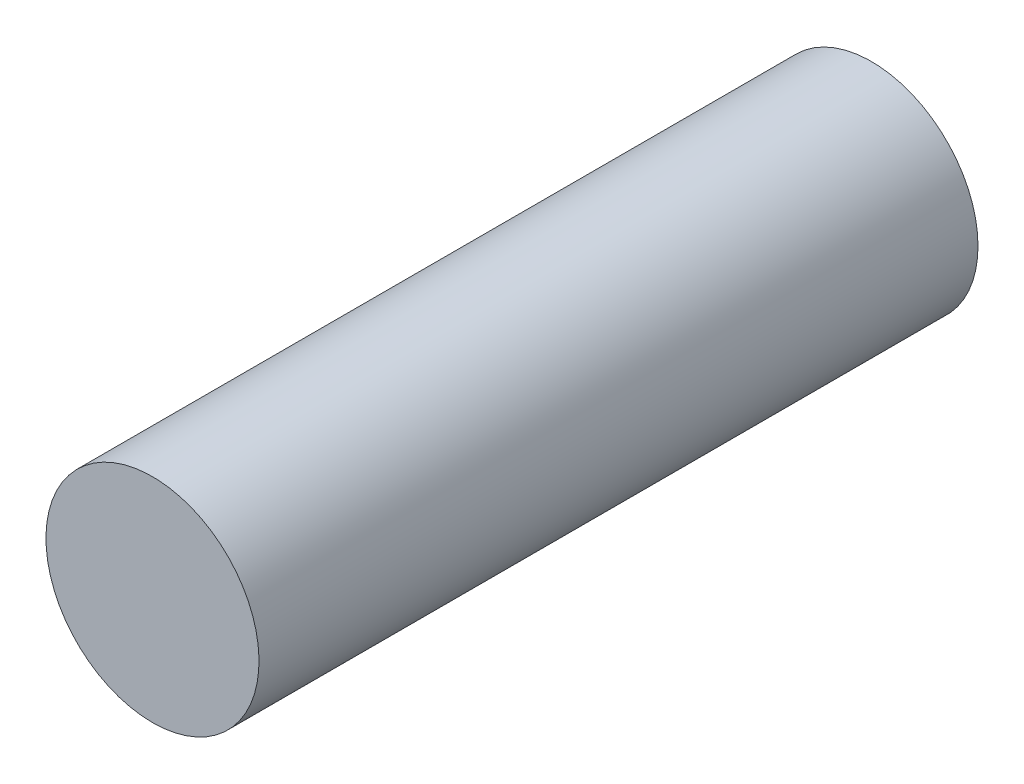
ISO-10303-21;
HEADER;
FILE_DESCRIPTION(('STEP AP214'),'2;1');
FILE_NAME('part.step','',(''),(''),'','','');
FILE_SCHEMA(('AUTOMOTIVE_DESIGN { 1 0 10303 214 1 1 1 1 }'));
ENDSEC;
DATA;
#1=APPLICATION_CONTEXT('core data for automotive mechanical design processes');
#2=APPLICATION_PROTOCOL_DEFINITION('international standard','automotive_design',2000,#1);
#3=PRODUCT_CONTEXT('',#1,'mechanical');
#4=PRODUCT('Part','Part','',(#3));
#5=PRODUCT_RELATED_PRODUCT_CATEGORY('part','',(#4));
#6=PRODUCT_DEFINITION_FORMATION('','',#4);
#7=PRODUCT_DEFINITION_CONTEXT('part definition',#1,'design');
#8=PRODUCT_DEFINITION('design','',#6,#7);
#9=PRODUCT_DEFINITION_SHAPE('','',#8);
#10=(LENGTH_UNIT() NAMED_UNIT(*) SI_UNIT(.MILLI.,.METRE.));
#11=(NAMED_UNIT(*) PLANE_ANGLE_UNIT() SI_UNIT($,.RADIAN.));
#12=(NAMED_UNIT(*) SI_UNIT($,.STERADIAN.) SOLID_ANGLE_UNIT());
#13=UNCERTAINTY_MEASURE_WITH_UNIT(LENGTH_MEASURE(1.E-05),#10,'distance_accuracy_value','');
#14=(GEOMETRIC_REPRESENTATION_CONTEXT(3) GLOBAL_UNCERTAINTY_ASSIGNED_CONTEXT((#13)) GLOBAL_UNIT_ASSIGNED_CONTEXT((#10,
#11,#12)) REPRESENTATION_CONTEXT('',''));
#15=CARTESIAN_POINT('',(0.,0.,0.));
#16=DIRECTION('',(0.,0.,1.));
#17=DIRECTION('',(1.,0.,0.));
#18=AXIS2_PLACEMENT_3D('',#15,#16,#17);
#19=CARTESIAN_POINT('',(43.,0.,95.7842712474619));
#20=DIRECTION('',(0.,0.,-1.));
#21=DIRECTION('',(-1.,0.,0.));
#22=AXIS2_PLACEMENT_3D('',#19,#20,#21);
#23=CYLINDRICAL_SURFACE('',#22,10.);
#24=CARTESIAN_POINT('',(43.,0.,0.));
#25=DIRECTION('',(0.,0.,1.));
#26=DIRECTION('',(1.,0.,0.));
#27=AXIS2_PLACEMENT_3D('',#24,#25,#26);
#28=CIRCLE('',#27,10.);
#29=CARTESIAN_POINT('',(53.,0.,0.));
#30=VERTEX_POINT('',#29);
#31=EDGE_CURVE('E38',#30,#30,#28,.T.);
#32=ORIENTED_EDGE('',*,*,#31,.T.);
#33=EDGE_LOOP('',(#32));
#34=FACE_BOUND('',#33,.T.);
#35=CARTESIAN_POINT('',(43.,0.,67.5));
#36=DIRECTION('',(0.,0.,1.));
#37=DIRECTION('',(0.,-1.,0.));
#38=AXIS2_PLACEMENT_3D('',#35,#36,#37);
#39=CIRCLE('',#38,10.);
#40=CARTESIAN_POINT('',(43.,-10.,67.5));
#41=VERTEX_POINT('',#40);
#42=EDGE_CURVE('E10',#41,#41,#39,.T.);
#43=ORIENTED_EDGE('',*,*,#42,.F.);
#44=EDGE_LOOP('',(#43));
#45=FACE_BOUND('',#44,.T.);
#46=ADVANCED_FACE('F31',(#34,#45),#23,.T.);
#47=CARTESIAN_POINT('',(43.,0.,0.));
#48=DIRECTION('',(0.,0.,1.));
#49=DIRECTION('',(1.,0.,0.));
#50=AXIS2_PLACEMENT_3D('',#47,#48,#49);
#51=PLANE('',#50);
#52=ORIENTED_EDGE('',*,*,#31,.F.);
#53=EDGE_LOOP('',(#52));
#54=FACE_BOUND('',#53,.T.);
#55=ADVANCED_FACE('F46',(#54),#51,.F.);
#56=CARTESIAN_POINT('',(25.2999999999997,-0.0499999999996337,67.5));
#57=DIRECTION('',(0.,0.,1.));
#58=DIRECTION('',(0.,-1.,0.));
#59=AXIS2_PLACEMENT_3D('',#56,#57,#58);
#60=PLANE('',#59);
#61=ORIENTED_EDGE('',*,*,#42,.T.);
#62=EDGE_LOOP('',(#61));
#63=FACE_BOUND('',#62,.T.);
#64=ADVANCED_FACE('F33',(#63),#60,.T.);
#65=CLOSED_SHELL('',(#46,#55,#64));
#66=MANIFOLD_SOLID_BREP('B2',#65);
#67=ADVANCED_BREP_SHAPE_REPRESENTATION('',(#18,#66),#14);
#68=SHAPE_DEFINITION_REPRESENTATION(#9,#67);
ENDSEC;
END-ISO-10303-21;
